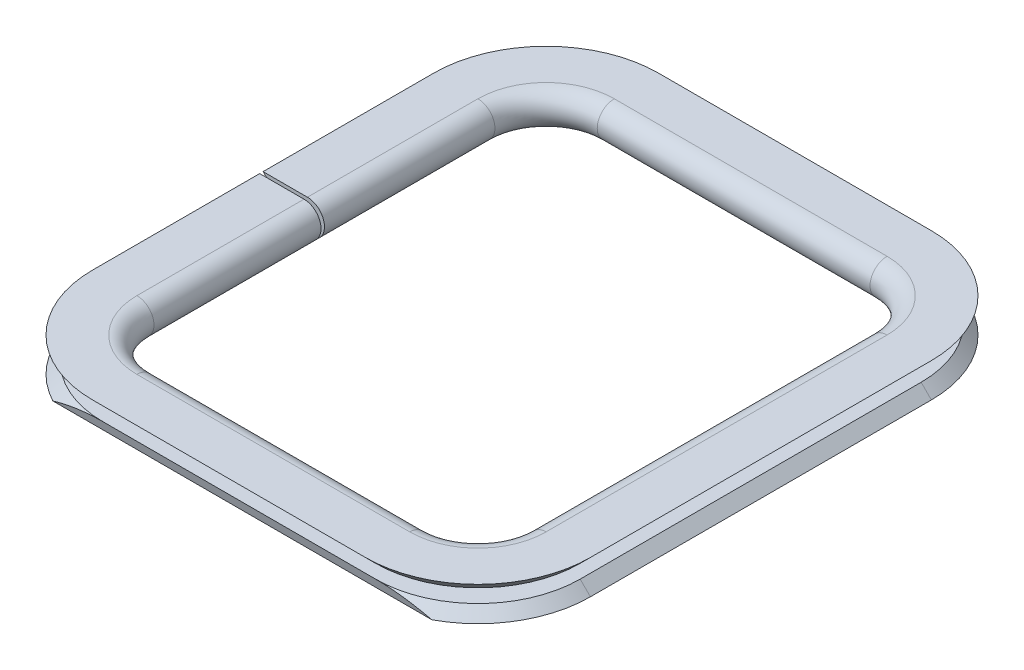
ISO-10303-21;
HEADER;
FILE_DESCRIPTION(('STEP AP214'),'2;1');
FILE_NAME('part.step','',(''),(''),'','','');
FILE_SCHEMA(('AUTOMOTIVE_DESIGN { 1 0 10303 214 1 1 1 1 }'));
ENDSEC;
DATA;
#1=APPLICATION_CONTEXT('core data for automotive mechanical design processes');
#2=APPLICATION_PROTOCOL_DEFINITION('international standard','automotive_design',2000,#1);
#3=PRODUCT_CONTEXT('',#1,'mechanical');
#4=PRODUCT('Part','Part','',(#3));
#5=PRODUCT_RELATED_PRODUCT_CATEGORY('part','',(#4));
#6=PRODUCT_DEFINITION_FORMATION('','',#4);
#7=PRODUCT_DEFINITION_CONTEXT('part definition',#1,'design');
#8=PRODUCT_DEFINITION('design','',#6,#7);
#9=PRODUCT_DEFINITION_SHAPE('','',#8);
#10=(LENGTH_UNIT() NAMED_UNIT(*) SI_UNIT(.MILLI.,.METRE.));
#11=(NAMED_UNIT(*) PLANE_ANGLE_UNIT() SI_UNIT($,.RADIAN.));
#12=(NAMED_UNIT(*) SI_UNIT($,.STERADIAN.) SOLID_ANGLE_UNIT());
#13=UNCERTAINTY_MEASURE_WITH_UNIT(LENGTH_MEASURE(1.E-05),#10,'distance_accuracy_value','');
#14=(GEOMETRIC_REPRESENTATION_CONTEXT(3) GLOBAL_UNCERTAINTY_ASSIGNED_CONTEXT((#13)) GLOBAL_UNIT_ASSIGNED_CONTEXT((#10,
#11,#12)) REPRESENTATION_CONTEXT('',''));
#15=CARTESIAN_POINT('',(0.,0.,0.));
#16=DIRECTION('',(0.,0.,1.));
#17=DIRECTION('',(1.,0.,0.));
#18=AXIS2_PLACEMENT_3D('',#15,#16,#17);
#19=CARTESIAN_POINT('',(-5.00000000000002,-1.,24.9999999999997));
#20=DIRECTION('',(0.707106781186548,-0.707106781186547,0.));
#21=DIRECTION('',(0.707106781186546,0.707106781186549,0.));
#22=AXIS2_PLACEMENT_3D('',#19,#20,#21);
#23=PLANE('',#22);
#24=DIRECTION('',(-0.707106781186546,-0.707106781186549,0.));
#25=VECTOR('',#24,1.);
#26=CARTESIAN_POINT('',(-5.00000000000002,-1.,24.9999999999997));
#27=LINE('',#26,#25);
#28=CARTESIAN_POINT('',(-5.00000000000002,-1.,24.9999999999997));
#29=VERTEX_POINT('',#28);
#30=CARTESIAN_POINT('',(-6.50000000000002,-2.49999999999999,24.9999999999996));
#31=VERTEX_POINT('',#30);
#32=EDGE_CURVE('E360',#29,#31,#27,.T.);
#33=ORIENTED_EDGE('',*,*,#32,.F.);
#34=DIRECTION('',(0.,0.,-1.));
#35=VECTOR('',#34,1.);
#36=CARTESIAN_POINT('',(-5.00000000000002,-1.,24.9999999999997));
#37=LINE('',#36,#35);
#38=CARTESIAN_POINT('',(-5.00000000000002,-1.,0.499999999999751));
#39=VERTEX_POINT('',#38);
#40=EDGE_CURVE('E317',#29,#39,#37,.T.);
#41=ORIENTED_EDGE('',*,*,#40,.T.);
#42=DIRECTION('',(-0.707106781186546,-0.707106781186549,0.));
#43=VECTOR('',#42,1.);
#44=CARTESIAN_POINT('',(-5.00000000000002,-1.,0.499999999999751));
#45=LINE('',#44,#43);
#46=CARTESIAN_POINT('',(-6.50000000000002,-2.5,0.49999999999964));
#47=VERTEX_POINT('',#46);
#48=EDGE_CURVE('E58',#39,#47,#45,.T.);
#49=ORIENTED_EDGE('',*,*,#48,.T.);
#50=DIRECTION('',(0.,0.,-1.));
#51=VECTOR('',#50,1.);
#52=CARTESIAN_POINT('',(-6.50000000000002,-2.49999999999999,24.9999999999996));
#53=LINE('',#52,#51);
#54=EDGE_CURVE('E43',#31,#47,#53,.T.);
#55=ORIENTED_EDGE('',*,*,#54,.F.);
#56=EDGE_LOOP('',(#33,#41,#49,#55));
#57=FACE_BOUND('',#56,.T.);
#58=ADVANCED_FACE('F36',(#57),#23,.F.);
#59=CARTESIAN_POINT('',(0.,-1.,25.));
#60=DIRECTION('',(1.,0.,0.));
#61=DIRECTION('',(0.,0.,-1.));
#62=AXIS2_PLACEMENT_3D('',#59,#60,#61);
#63=PLANE('',#62);
#64=DIRECTION('',(0.,-1.,0.));
#65=VECTOR('',#64,1.);
#66=CARTESIAN_POINT('',(0.,-1.,25.));
#67=LINE('',#66,#65);
#68=CARTESIAN_POINT('',(0.,1.,25.));
#69=VERTEX_POINT('',#68);
#70=CARTESIAN_POINT('',(0.,-1.,25.));
#71=VERTEX_POINT('',#70);
#72=EDGE_CURVE('E362',#69,#71,#67,.T.);
#73=ORIENTED_EDGE('',*,*,#72,.F.);
#74=DIRECTION('',(0.,0.,-1.));
#75=VECTOR('',#74,1.);
#76=CARTESIAN_POINT('',(0.,1.,25.));
#77=LINE('',#76,#75);
#78=CARTESIAN_POINT('',(0.,1.,0.5));
#79=VERTEX_POINT('',#78);
#80=EDGE_CURVE('E353',#69,#79,#77,.T.);
#81=ORIENTED_EDGE('',*,*,#80,.T.);
#82=DIRECTION('',(0.,-1.,0.));
#83=VECTOR('',#82,1.);
#84=CARTESIAN_POINT('',(0.,-1.,0.500000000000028));
#85=LINE('',#84,#83);
#86=CARTESIAN_POINT('',(0.,-1.,0.500000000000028));
#87=VERTEX_POINT('',#86);
#88=EDGE_CURVE('E338',#79,#87,#85,.T.);
#89=ORIENTED_EDGE('',*,*,#88,.T.);
#90=DIRECTION('',(0.,0.,-1.));
#91=VECTOR('',#90,1.);
#92=CARTESIAN_POINT('',(0.,-1.,25.));
#93=LINE('',#92,#91);
#94=EDGE_CURVE('E356',#71,#87,#93,.T.);
#95=ORIENTED_EDGE('',*,*,#94,.F.);
#96=EDGE_LOOP('',(#73,#81,#89,#95));
#97=FACE_BOUND('',#96,.T.);
#98=ADVANCED_FACE('F392',(#97),#63,.F.);
#99=CARTESIAN_POINT('',(-5.00000000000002,1.,24.9999999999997));
#100=DIRECTION('',(0.707106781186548,0.707106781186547,0.));
#101=DIRECTION('',(-0.707106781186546,0.707106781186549,0.));
#102=AXIS2_PLACEMENT_3D('',#99,#100,#101);
#103=PLANE('',#102);
#104=DIRECTION('',(0.707106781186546,-0.707106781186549,0.));
#105=VECTOR('',#104,1.);
#106=CARTESIAN_POINT('',(-5.00000000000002,1.,24.9999999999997));
#107=LINE('',#106,#105);
#108=CARTESIAN_POINT('',(-6.50000000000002,2.5,24.9999999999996));
#109=VERTEX_POINT('',#108);
#110=CARTESIAN_POINT('',(-5.00000000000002,1.,24.9999999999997));
#111=VERTEX_POINT('',#110);
#112=EDGE_CURVE('E368',#109,#111,#107,.T.);
#113=ORIENTED_EDGE('',*,*,#112,.F.);
#114=DIRECTION('',(0.,0.,-1.));
#115=VECTOR('',#114,1.);
#116=CARTESIAN_POINT('',(-6.50000000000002,2.5,24.9999999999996));
#117=LINE('',#116,#115);
#118=CARTESIAN_POINT('',(-6.50000000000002,2.5,0.49999999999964));
#119=VERTEX_POINT('',#118);
#120=EDGE_CURVE('E347',#109,#119,#117,.T.);
#121=ORIENTED_EDGE('',*,*,#120,.T.);
#122=DIRECTION('',(0.707106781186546,-0.707106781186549,0.));
#123=VECTOR('',#122,1.);
#124=CARTESIAN_POINT('',(-5.00000000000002,1.,0.499999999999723));
#125=LINE('',#124,#123);
#126=CARTESIAN_POINT('',(-5.00000000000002,1.,0.499999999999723));
#127=VERTEX_POINT('',#126);
#128=EDGE_CURVE('E334',#119,#127,#125,.T.);
#129=ORIENTED_EDGE('',*,*,#128,.T.);
#130=DIRECTION('',(0.,0.,-1.));
#131=VECTOR('',#130,1.);
#132=CARTESIAN_POINT('',(-5.00000000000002,1.,24.9999999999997));
#133=LINE('',#132,#131);
#134=EDGE_CURVE('E350',#111,#127,#133,.T.);
#135=ORIENTED_EDGE('',*,*,#134,.F.);
#136=EDGE_LOOP('',(#113,#121,#129,#135));
#137=FACE_BOUND('',#136,.T.);
#138=ADVANCED_FACE('F680',(#137),#103,.F.);
#139=CARTESIAN_POINT('',(0.,0.,25.));
#140=DIRECTION('',(0.,0.,-1.));
#141=DIRECTION('',(-1.,0.,0.));
#142=AXIS2_PLACEMENT_3D('',#139,#140,#141);
#143=CYLINDRICAL_SURFACE('',#142,2.5);
#144=CARTESIAN_POINT('',(0.,0.,25.));
#145=DIRECTION('',(0.,0.,1.));
#146=DIRECTION('',(-1.,0.,0.));
#147=AXIS2_PLACEMENT_3D('',#144,#145,#146);
#148=CIRCLE('',#147,2.5);
#149=CARTESIAN_POINT('',(0.,-2.49999999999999,25.));
#150=VERTEX_POINT('',#149);
#151=CARTESIAN_POINT('',(0.,2.5,24.9999999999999));
#152=VERTEX_POINT('',#151);
#153=EDGE_CURVE('E419',#150,#152,#148,.T.);
#154=ORIENTED_EDGE('',*,*,#153,.F.);
#155=DIRECTION('',(0.,0.,-1.));
#156=VECTOR('',#155,1.);
#157=CARTESIAN_POINT('',(0.,-2.49999999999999,25.));
#158=LINE('',#157,#156);
#159=CARTESIAN_POINT('',(0.,-2.5,0.500000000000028));
#160=VERTEX_POINT('',#159);
#161=EDGE_CURVE('E11',#150,#160,#158,.T.);
#162=ORIENTED_EDGE('',*,*,#161,.T.);
#163=CARTESIAN_POINT('',(0.,0.,0.5));
#164=DIRECTION('',(0.,0.,1.));
#165=DIRECTION('',(-1.,0.,0.));
#166=AXIS2_PLACEMENT_3D('',#163,#164,#165);
#167=CIRCLE('',#166,2.5);
#168=CARTESIAN_POINT('',(0.,2.5,0.5));
#169=VERTEX_POINT('',#168);
#170=EDGE_CURVE('E330',#160,#169,#167,.T.);
#171=ORIENTED_EDGE('',*,*,#170,.T.);
#172=DIRECTION('',(0.,0.,-1.));
#173=VECTOR('',#172,1.);
#174=CARTESIAN_POINT('',(0.,2.5,24.9999999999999));
#175=LINE('',#174,#173);
#176=EDGE_CURVE('E344',#152,#169,#175,.T.);
#177=ORIENTED_EDGE('',*,*,#176,.F.);
#178=EDGE_LOOP('',(#154,#162,#171,#177));
#179=FACE_BOUND('',#178,.T.);
#180=ADVANCED_FACE('F684',(#179),#143,.T.);
#181=CARTESIAN_POINT('',(9.99999999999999,-1.,25.));
#182=DIRECTION('',(0.,-1.,0.));
#183=DIRECTION('',(0.,0.,-1.));
#184=AXIS2_PLACEMENT_3D('',#181,#182,#183);
#185=CONICAL_SURFACE('',#184,15.,0.785398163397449);
#186=CARTESIAN_POINT('',(9.99999999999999,-2.5,25.));
#187=DIRECTION('',(0.,-1.,0.));
#188=DIRECTION('',(0.,0.,-1.));
#189=AXIS2_PLACEMENT_3D('',#186,#187,#188);
#190=CIRCLE('',#189,16.5);
#191=CARTESIAN_POINT('',(2.20272032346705,-2.5,39.541403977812));
#192=VERTEX_POINT('',#191);
#193=EDGE_CURVE('E312',#192,#31,#190,.T.);
#194=ORIENTED_EDGE('',*,*,#193,.F.);
#195=CARTESIAN_POINT('',(2.2021830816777,-2.50020000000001,39.5413428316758));
#196=CARTESIAN_POINT('',(2.51389221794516,-2.3841539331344,39.5768216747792));
#197=CARTESIAN_POINT('',(2.82779457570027,-2.27337882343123,39.6106890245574));
#198=CARTESIAN_POINT('',(3.45993302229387,-2.0634490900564,39.6748709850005));
#199=CARTESIAN_POINT('',(3.77817055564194,-1.96429845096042,39.7051843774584));
#200=CARTESIAN_POINT('',(4.41588864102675,-1.77959520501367,39.7616538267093));
#201=CARTESIAN_POINT('',(4.73533347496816,-1.6939303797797,39.7878441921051));
#202=CARTESIAN_POINT('',(5.37787762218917,-1.53624564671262,39.8360532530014));
#203=CARTESIAN_POINT('',(5.70097671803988,-1.46422493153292,39.8580721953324));
#204=CARTESIAN_POINT('',(6.35085099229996,-1.33474981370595,39.8976567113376));
#205=CARTESIAN_POINT('',(6.67763078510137,-1.27731648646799,39.9152158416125));
#206=CARTESIAN_POINT('',(7.33377150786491,-1.1780521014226,39.945564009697));
#207=CARTESIAN_POINT('',(7.66313238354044,-1.13622071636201,39.9583531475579));
#208=CARTESIAN_POINT('',(8.32658992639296,-1.06857265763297,39.9790352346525));
#209=CARTESIAN_POINT('',(8.66070281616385,-1.04289929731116,39.986884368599));
#210=CARTESIAN_POINT('',(9.16259587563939,-1.0171809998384,39.9947472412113));
#211=CARTESIAN_POINT('',(9.33004066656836,-1.01074018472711,39.9967163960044));
#212=CARTESIAN_POINT('',(9.66505419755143,-1.00214766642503,39.9993433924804));
#213=CARTESIAN_POINT('',(9.83262294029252,-0.99999605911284,40.0000012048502));
#214=CARTESIAN_POINT('',(10.0001999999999,-1.00000000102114,39.9999999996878));
#215=B_SPLINE_CURVE_WITH_KNOTS('',3,(#195,#196,#197,#198,#199,#200,#201,#202,#203,#204,#205,
#206,#207,#208,#209,#210,#211,#212,#213,#214),.UNSPECIFIED.,.F.,.F.,(4,2,2,2,2,2,2,2,2,4),(0.,
1.00350352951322,2.00735003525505,3.00234287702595,3.99727682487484,4.99364014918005,
5.98998257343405,6.99504191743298,7.49773028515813,8.00042988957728),.UNSPECIFIED.);
#216=CARTESIAN_POINT('',(9.99999999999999,-1.00000000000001,40.));
#217=VERTEX_POINT('',#216);
#218=EDGE_CURVE('E296',#192,#217,#215,.T.);
#219=ORIENTED_EDGE('',*,*,#218,.T.);
#220=CARTESIAN_POINT('',(9.99999999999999,-1.,25.));
#221=DIRECTION('',(0.,-1.,0.));
#222=DIRECTION('',(0.,0.,-1.));
#223=AXIS2_PLACEMENT_3D('',#220,#221,#222);
#224=CIRCLE('',#223,15.);
#225=EDGE_CURVE('E311',#217,#29,#224,.T.);
#226=ORIENTED_EDGE('',*,*,#225,.T.);
#227=ORIENTED_EDGE('',*,*,#32,.T.);
#228=EDGE_LOOP('',(#194,#219,#226,#227));
#229=FACE_BOUND('',#228,.T.);
#230=ADVANCED_FACE('F309',(#229),#185,.T.);
#231=CARTESIAN_POINT('',(9.99999999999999,0.,25.));
#232=DIRECTION('',(0.,-1.,0.));
#233=DIRECTION('',(0.,0.,-1.));
#234=AXIS2_PLACEMENT_3D('',#231,#232,#233);
#235=CYLINDRICAL_SURFACE('',#234,10.);
#236=DIRECTION('',(0.,-1.,0.));
#237=VECTOR('',#236,1.);
#238=CARTESIAN_POINT('',(10.0000000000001,-1.,35.));
#239=LINE('',#238,#237);
#240=CARTESIAN_POINT('',(10.0000000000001,1.,35.));
#241=VERTEX_POINT('',#240);
#242=CARTESIAN_POINT('',(10.0000000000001,-1.,35.));
#243=VERTEX_POINT('',#242);
#244=EDGE_CURVE('E382',#241,#243,#239,.T.);
#245=ORIENTED_EDGE('',*,*,#244,.F.);
#246=CARTESIAN_POINT('',(9.99999999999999,1.,25.));
#247=DIRECTION('',(0.,-1.,0.));
#248=DIRECTION('',(0.,0.,-1.));
#249=AXIS2_PLACEMENT_3D('',#246,#247,#248);
#250=CIRCLE('',#249,10.);
#251=EDGE_CURVE('E324',#241,#69,#250,.T.);
#252=ORIENTED_EDGE('',*,*,#251,.T.);
#253=ORIENTED_EDGE('',*,*,#72,.T.);
#254=CARTESIAN_POINT('',(9.99999999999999,-1.,25.));
#255=DIRECTION('',(0.,-1.,0.));
#256=DIRECTION('',(0.,0.,-1.));
#257=AXIS2_PLACEMENT_3D('',#254,#255,#256);
#258=CIRCLE('',#257,10.);
#259=EDGE_CURVE('E319',#243,#71,#258,.T.);
#260=ORIENTED_EDGE('',*,*,#259,.F.);
#261=EDGE_LOOP('',(#245,#252,#253,#260));
#262=FACE_BOUND('',#261,.T.);
#263=ADVANCED_FACE('F379',(#262),#235,.T.);
#264=CARTESIAN_POINT('',(9.99999999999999,2.49999999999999,25.));
#265=DIRECTION('',(0.,1.,0.));
#266=DIRECTION('',(0.,0.,1.));
#267=AXIS2_PLACEMENT_3D('',#264,#265,#266);
#268=CONICAL_SURFACE('',#267,16.5,0.785398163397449);
#269=DIRECTION('',(0.,-0.707106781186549,-0.707106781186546));
#270=VECTOR('',#269,1.);
#271=CARTESIAN_POINT('',(9.99999999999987,0.999999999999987,40.));
#272=LINE('',#271,#270);
#273=CARTESIAN_POINT('',(9.9999999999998,2.49999999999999,41.5));
#274=VERTEX_POINT('',#273);
#275=CARTESIAN_POINT('',(9.99999999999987,0.999999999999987,40.));
#276=VERTEX_POINT('',#275);
#277=EDGE_CURVE('E400',#274,#276,#272,.T.);
#278=ORIENTED_EDGE('',*,*,#277,.F.);
#279=CARTESIAN_POINT('',(9.99999999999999,2.49999999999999,25.));
#280=DIRECTION('',(0.,-1.,0.));
#281=DIRECTION('',(0.,0.,-1.));
#282=AXIS2_PLACEMENT_3D('',#279,#280,#281);
#283=CIRCLE('',#282,16.5);
#284=EDGE_CURVE('E365',#274,#109,#283,.T.);
#285=ORIENTED_EDGE('',*,*,#284,.T.);
#286=ORIENTED_EDGE('',*,*,#112,.T.);
#287=CARTESIAN_POINT('',(9.99999999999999,1.,25.));
#288=DIRECTION('',(0.,-1.,0.));
#289=DIRECTION('',(0.,0.,-1.));
#290=AXIS2_PLACEMENT_3D('',#287,#288,#289);
#291=CIRCLE('',#290,15.);
#292=EDGE_CURVE('E374',#276,#111,#291,.T.);
#293=ORIENTED_EDGE('',*,*,#292,.F.);
#294=EDGE_LOOP('',(#278,#285,#286,#293));
#295=FACE_BOUND('',#294,.T.);
#296=ADVANCED_FACE('F425',(#295),#268,.T.);
#297=CARTESIAN_POINT('',(9.99999999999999,0.,25.));
#298=DIRECTION('',(0.,-1.,0.));
#299=DIRECTION('',(0.,0.,-1.));
#300=AXIS2_PLACEMENT_3D('',#297,#298,#299);
#301=TOROIDAL_SURFACE('',#300,10.,2.5);
#302=CARTESIAN_POINT('',(10.0000000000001,0.,35.));
#303=DIRECTION('',(1.,0.,0.));
#304=DIRECTION('',(0.,0.,1.));
#305=AXIS2_PLACEMENT_3D('',#302,#303,#304);
#306=CIRCLE('',#305,2.5);
#307=CARTESIAN_POINT('',(10.0000000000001,-2.5,35.));
#308=VERTEX_POINT('',#307);
#309=CARTESIAN_POINT('',(10.0000000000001,2.49999999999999,35.));
#310=VERTEX_POINT('',#309);
#311=EDGE_CURVE('E406',#308,#310,#306,.T.);
#312=ORIENTED_EDGE('',*,*,#311,.F.);
#313=CARTESIAN_POINT('',(9.99999999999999,-2.5,25.));
#314=DIRECTION('',(0.,-1.,0.));
#315=DIRECTION('',(0.,0.,-1.));
#316=AXIS2_PLACEMENT_3D('',#313,#314,#315);
#317=CIRCLE('',#316,10.);
#318=EDGE_CURVE('E321',#308,#150,#317,.T.);
#319=ORIENTED_EDGE('',*,*,#318,.T.);
#320=ORIENTED_EDGE('',*,*,#153,.T.);
#321=CARTESIAN_POINT('',(9.99999999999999,2.49999999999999,25.));
#322=DIRECTION('',(0.,-1.,0.));
#323=DIRECTION('',(0.,0.,-1.));
#324=AXIS2_PLACEMENT_3D('',#321,#322,#323);
#325=CIRCLE('',#324,10.);
#326=EDGE_CURVE('E361',#310,#152,#325,.T.);
#327=ORIENTED_EDGE('',*,*,#326,.F.);
#328=EDGE_LOOP('',(#312,#319,#320,#327));
#329=FACE_BOUND('',#328,.T.);
#330=ADVANCED_FACE('F1083',(#329),#301,.T.);
#331=CARTESIAN_POINT('',(49.9999999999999,-1.,35.));
#332=DIRECTION('',(0.,0.,-1.));
#333=DIRECTION('',(-1.,0.,0.));
#334=AXIS2_PLACEMENT_3D('',#331,#332,#333);
#335=PLANE('',#334);
#336=DIRECTION('',(0.,-1.,0.));
#337=VECTOR('',#336,1.);
#338=CARTESIAN_POINT('',(49.9999999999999,-1.,35.));
#339=LINE('',#338,#337);
#340=CARTESIAN_POINT('',(49.9999999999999,1.,35.));
#341=VERTEX_POINT('',#340);
#342=CARTESIAN_POINT('',(49.9999999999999,-1.,35.));
#343=VERTEX_POINT('',#342);
#344=EDGE_CURVE('E441',#341,#343,#339,.T.);
#345=ORIENTED_EDGE('',*,*,#344,.F.);
#346=DIRECTION('',(-1.,0.,0.));
#347=VECTOR('',#346,1.);
#348=CARTESIAN_POINT('',(49.9999999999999,1.,35.));
#349=LINE('',#348,#347);
#350=EDGE_CURVE('E387',#341,#241,#349,.T.);
#351=ORIENTED_EDGE('',*,*,#350,.T.);
#352=ORIENTED_EDGE('',*,*,#244,.T.);
#353=DIRECTION('',(-1.,0.,0.));
#354=VECTOR('',#353,1.);
#355=CARTESIAN_POINT('',(49.9999999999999,-1.,35.));
#356=LINE('',#355,#354);
#357=EDGE_CURVE('E304',#343,#243,#356,.T.);
#358=ORIENTED_EDGE('',*,*,#357,.F.);
#359=EDGE_LOOP('',(#345,#351,#352,#358));
#360=FACE_BOUND('',#359,.T.);
#361=ADVANCED_FACE('F397',(#360),#335,.F.);
#362=CARTESIAN_POINT('',(49.9999999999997,1.,40.));
#363=DIRECTION('',(0.,0.707106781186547,-0.707106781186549));
#364=DIRECTION('',(0.,0.707106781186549,0.707106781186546));
#365=AXIS2_PLACEMENT_3D('',#362,#363,#364);
#366=PLANE('',#365);
#367=DIRECTION('',(0.,-0.707106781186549,-0.707106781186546));
#368=VECTOR('',#367,1.);
#369=CARTESIAN_POINT('',(49.9999999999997,1.,40.));
#370=LINE('',#369,#368);
#371=CARTESIAN_POINT('',(49.9999999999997,2.5,41.5));
#372=VERTEX_POINT('',#371);
#373=CARTESIAN_POINT('',(49.9999999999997,1.,40.));
#374=VERTEX_POINT('',#373);
#375=EDGE_CURVE('E434',#372,#374,#370,.T.);
#376=ORIENTED_EDGE('',*,*,#375,.F.);
#377=DIRECTION('',(-1.,0.,0.));
#378=VECTOR('',#377,1.);
#379=CARTESIAN_POINT('',(49.9999999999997,2.5,41.5));
#380=LINE('',#379,#378);
#381=EDGE_CURVE('E403',#372,#274,#380,.T.);
#382=ORIENTED_EDGE('',*,*,#381,.T.);
#383=ORIENTED_EDGE('',*,*,#277,.T.);
#384=DIRECTION('',(-1.,0.,0.));
#385=VECTOR('',#384,1.);
#386=CARTESIAN_POINT('',(49.9999999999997,1.,40.));
#387=LINE('',#386,#385);
#388=EDGE_CURVE('E412',#374,#276,#387,.T.);
#389=ORIENTED_EDGE('',*,*,#388,.F.);
#390=EDGE_LOOP('',(#376,#382,#383,#389));
#391=FACE_BOUND('',#390,.T.);
#392=ADVANCED_FACE('F433',(#391),#366,.F.);
#393=CARTESIAN_POINT('',(49.9999999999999,0.,35.));
#394=DIRECTION('',(-1.,0.,0.));
#395=DIRECTION('',(0.,0.,1.));
#396=AXIS2_PLACEMENT_3D('',#393,#394,#395);
#397=CYLINDRICAL_SURFACE('',#396,2.5);
#398=CARTESIAN_POINT('',(49.9999999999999,0.,35.));
#399=DIRECTION('',(1.,0.,0.));
#400=DIRECTION('',(0.,0.,1.));
#401=AXIS2_PLACEMENT_3D('',#398,#399,#400);
#402=CIRCLE('',#401,2.5);
#403=CARTESIAN_POINT('',(49.9999999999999,-2.49999999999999,35.));
#404=VERTEX_POINT('',#403);
#405=CARTESIAN_POINT('',(49.9999999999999,2.5,35.));
#406=VERTEX_POINT('',#405);
#407=EDGE_CURVE('E442',#404,#406,#402,.T.);
#408=ORIENTED_EDGE('',*,*,#407,.F.);
#409=DIRECTION('',(-1.,0.,0.));
#410=VECTOR('',#409,1.);
#411=CARTESIAN_POINT('',(49.9999999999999,-2.49999999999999,35.));
#412=LINE('',#411,#410);
#413=EDGE_CURVE('E303',#404,#308,#412,.T.);
#414=ORIENTED_EDGE('',*,*,#413,.T.);
#415=ORIENTED_EDGE('',*,*,#311,.T.);
#416=DIRECTION('',(-1.,0.,0.));
#417=VECTOR('',#416,1.);
#418=CARTESIAN_POINT('',(49.9999999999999,2.5,35.));
#419=LINE('',#418,#417);
#420=EDGE_CURVE('E399',#406,#310,#419,.T.);
#421=ORIENTED_EDGE('',*,*,#420,.F.);
#422=EDGE_LOOP('',(#408,#414,#415,#421));
#423=FACE_BOUND('',#422,.T.);
#424=ADVANCED_FACE('F471',(#423),#397,.T.);
#425=CARTESIAN_POINT('',(50.,-0.999999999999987,25.));
#426=DIRECTION('',(0.,-1.,0.));
#427=DIRECTION('',(0.,0.,-1.));
#428=AXIS2_PLACEMENT_3D('',#425,#426,#427);
#429=CONICAL_SURFACE('',#428,15.,0.785398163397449);
#430=CARTESIAN_POINT('',(50.,-0.999999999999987,25.));
#431=DIRECTION('',(0.,-1.,0.));
#432=DIRECTION('',(0.,0.,-1.));
#433=AXIS2_PLACEMENT_3D('',#430,#431,#432);
#434=CIRCLE('',#433,15.);
#435=CARTESIAN_POINT('',(65.,-1.,25.));
#436=VERTEX_POINT('',#435);
#437=CARTESIAN_POINT('',(49.9999999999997,-1.,40.));
#438=VERTEX_POINT('',#437);
#439=EDGE_CURVE('E460',#436,#438,#434,.T.);
#440=ORIENTED_EDGE('',*,*,#439,.T.);
#441=CARTESIAN_POINT('',(49.9997999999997,-1.00000000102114,39.9999999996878));
#442=CARTESIAN_POINT('',(50.2779141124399,-0.999971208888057,40.0000088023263));
#443=CARTESIAN_POINT('',(50.556019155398,-1.00591732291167,39.9981908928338));
#444=CARTESIAN_POINT('',(51.1116486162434,-1.02956695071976,39.9909604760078));
#445=CARTESIAN_POINT('',(51.3891731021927,-1.04726899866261,39.9855484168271));
#446=CARTESIAN_POINT('',(51.9428298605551,-1.09421114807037,39.9711967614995));
#447=CARTESIAN_POINT('',(52.218963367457,-1.1234379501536,39.9622612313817));
#448=CARTESIAN_POINT('',(52.7696737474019,-1.19306034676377,39.9409755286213));
#449=CARTESIAN_POINT('',(53.0442505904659,-1.23345615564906,39.9286252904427));
#450=CARTESIAN_POINT('',(53.8580528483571,-1.36956764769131,39.8870118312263));
#451=CARTESIAN_POINT('',(54.394495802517,-1.48083667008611,39.8529934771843));
#452=CARTESIAN_POINT('',(55.4572116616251,-1.74074452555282,39.773531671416));
#453=CARTESIAN_POINT('',(55.9834851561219,-1.88938118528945,39.7280888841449));
#454=CARTESIAN_POINT('',(56.7213660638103,-2.12301140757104,39.6566609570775));
#455=CARTESIAN_POINT('',(56.9377037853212,-2.19464563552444,39.6347601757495));
#456=CARTESIAN_POINT('',(57.3689713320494,-2.3434138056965,39.5892771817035));
#457=CARTESIAN_POINT('',(57.5838956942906,-2.4205622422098,39.5656905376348));
#458=CARTESIAN_POINT('',(57.7978169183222,-2.50020000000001,39.5413428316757));
#459=B_SPLINE_CURVE_WITH_KNOTS('',3,(#441,#442,#443,#444,#445,#446,#447,#448,#449,#450,#451,
#452,#453,#454,#455,#456,#457,#458),.UNSPECIFIED.,.F.,.F.,(4,2,2,2,2,2,2,2,4),(0.,
0.834257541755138,1.66841107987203,2.50160482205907,3.33481455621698,4.97977312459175,
6.62463604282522,7.31139498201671,8.00003064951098),.UNSPECIFIED.);
#460=CARTESIAN_POINT('',(57.7972796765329,-2.50000000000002,39.541403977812));
#461=VERTEX_POINT('',#460);
#462=EDGE_CURVE('E299',#438,#461,#459,.T.);
#463=ORIENTED_EDGE('',*,*,#462,.T.);
#464=CARTESIAN_POINT('',(50.,-2.49999999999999,25.));
#465=DIRECTION('',(0.,-1.,0.));
#466=DIRECTION('',(0.,0.,-1.));
#467=AXIS2_PLACEMENT_3D('',#464,#465,#466);
#468=CIRCLE('',#467,16.5);
#469=CARTESIAN_POINT('',(66.5,-2.5,25.0000000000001));
#470=VERTEX_POINT('',#469);
#471=EDGE_CURVE('E462',#470,#461,#468,.T.);
#472=ORIENTED_EDGE('',*,*,#471,.F.);
#473=DIRECTION('',(0.707106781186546,-0.707106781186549,0.));
#474=VECTOR('',#473,1.);
#475=CARTESIAN_POINT('',(65.,-1.,25.));
#476=LINE('',#475,#474);
#477=EDGE_CURVE('E501',#436,#470,#476,.T.);
#478=ORIENTED_EDGE('',*,*,#477,.F.);
#479=EDGE_LOOP('',(#440,#463,#472,#478));
#480=FACE_BOUND('',#479,.T.);
#481=ADVANCED_FACE('F1053',(#480),#429,.T.);
#482=CARTESIAN_POINT('',(50.,0.,25.));
#483=DIRECTION('',(0.,-1.,0.));
#484=DIRECTION('',(0.,0.,-1.));
#485=AXIS2_PLACEMENT_3D('',#482,#483,#484);
#486=CYLINDRICAL_SURFACE('',#485,10.);
#487=DIRECTION('',(0.,-1.,0.));
#488=VECTOR('',#487,1.);
#489=CARTESIAN_POINT('',(60.,-1.,24.9999999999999));
#490=LINE('',#489,#488);
#491=CARTESIAN_POINT('',(60.,1.,24.9999999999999));
#492=VERTEX_POINT('',#491);
#493=CARTESIAN_POINT('',(60.,-1.,24.9999999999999));
#494=VERTEX_POINT('',#493);
#495=EDGE_CURVE('E492',#492,#494,#490,.T.);
#496=ORIENTED_EDGE('',*,*,#495,.F.);
#497=CARTESIAN_POINT('',(50.,1.,25.));
#498=DIRECTION('',(0.,-1.,0.));
#499=DIRECTION('',(0.,0.,-1.));
#500=AXIS2_PLACEMENT_3D('',#497,#498,#499);
#501=CIRCLE('',#500,10.);
#502=EDGE_CURVE('E455',#492,#341,#501,.T.);
#503=ORIENTED_EDGE('',*,*,#502,.T.);
#504=ORIENTED_EDGE('',*,*,#344,.T.);
#505=CARTESIAN_POINT('',(50.,-0.999999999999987,25.));
#506=DIRECTION('',(0.,-1.,0.));
#507=DIRECTION('',(0.,0.,-1.));
#508=AXIS2_PLACEMENT_3D('',#505,#506,#507);
#509=CIRCLE('',#508,10.);
#510=EDGE_CURVE('E458',#494,#343,#509,.T.);
#511=ORIENTED_EDGE('',*,*,#510,.F.);
#512=EDGE_LOOP('',(#496,#503,#504,#511));
#513=FACE_BOUND('',#512,.T.);
#514=ADVANCED_FACE('F1045',(#513),#486,.T.);
#515=CARTESIAN_POINT('',(50.,2.5,25.));
#516=DIRECTION('',(0.,1.,0.));
#517=DIRECTION('',(0.,0.,1.));
#518=AXIS2_PLACEMENT_3D('',#515,#516,#517);
#519=CONICAL_SURFACE('',#518,16.5,0.785398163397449);
#520=DIRECTION('',(-0.707106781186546,-0.707106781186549,0.));
#521=VECTOR('',#520,1.);
#522=CARTESIAN_POINT('',(65.,1.,25.));
#523=LINE('',#522,#521);
#524=CARTESIAN_POINT('',(66.5,2.5,25.0000000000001));
#525=VERTEX_POINT('',#524);
#526=CARTESIAN_POINT('',(65.,1.,25.));
#527=VERTEX_POINT('',#526);
#528=EDGE_CURVE('E489',#525,#527,#523,.T.);
#529=ORIENTED_EDGE('',*,*,#528,.F.);
#530=CARTESIAN_POINT('',(50.,2.5,25.));
#531=DIRECTION('',(0.,-1.,0.));
#532=DIRECTION('',(0.,0.,-1.));
#533=AXIS2_PLACEMENT_3D('',#530,#531,#532);
#534=CIRCLE('',#533,16.5);
#535=EDGE_CURVE('E440',#525,#372,#534,.T.);
#536=ORIENTED_EDGE('',*,*,#535,.T.);
#537=ORIENTED_EDGE('',*,*,#375,.T.);
#538=CARTESIAN_POINT('',(50.,1.,25.));
#539=DIRECTION('',(0.,-1.,0.));
#540=DIRECTION('',(0.,0.,-1.));
#541=AXIS2_PLACEMENT_3D('',#538,#539,#540);
#542=CIRCLE('',#541,15.);
#543=EDGE_CURVE('E429',#527,#374,#542,.T.);
#544=ORIENTED_EDGE('',*,*,#543,.F.);
#545=EDGE_LOOP('',(#529,#536,#537,#544));
#546=FACE_BOUND('',#545,.T.);
#547=ADVANCED_FACE('F438',(#546),#519,.T.);
#548=CARTESIAN_POINT('',(50.,0.,25.));
#549=DIRECTION('',(0.,-1.,0.));
#550=DIRECTION('',(0.,0.,-1.));
#551=AXIS2_PLACEMENT_3D('',#548,#549,#550);
#552=TOROIDAL_SURFACE('',#551,10.,2.5);
#553=CARTESIAN_POINT('',(60.,0.,24.9999999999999));
#554=DIRECTION('',(0.,0.,-1.));
#555=DIRECTION('',(1.,0.,0.));
#556=AXIS2_PLACEMENT_3D('',#553,#554,#555);
#557=CIRCLE('',#556,2.5);
#558=CARTESIAN_POINT('',(60.,-2.5,24.9999999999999));
#559=VERTEX_POINT('',#558);
#560=CARTESIAN_POINT('',(60.,2.49999999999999,24.9999999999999));
#561=VERTEX_POINT('',#560);
#562=EDGE_CURVE('E483',#559,#561,#557,.T.);
#563=ORIENTED_EDGE('',*,*,#562,.F.);
#564=CARTESIAN_POINT('',(50.,-2.49999999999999,25.));
#565=DIRECTION('',(0.,-1.,0.));
#566=DIRECTION('',(0.,0.,-1.));
#567=AXIS2_PLACEMENT_3D('',#564,#565,#566);
#568=CIRCLE('',#567,10.);
#569=EDGE_CURVE('E465',#559,#404,#568,.T.);
#570=ORIENTED_EDGE('',*,*,#569,.T.);
#571=ORIENTED_EDGE('',*,*,#407,.T.);
#572=CARTESIAN_POINT('',(50.,2.5,25.));
#573=DIRECTION('',(0.,-1.,0.));
#574=DIRECTION('',(0.,0.,-1.));
#575=AXIS2_PLACEMENT_3D('',#572,#573,#574);
#576=CIRCLE('',#575,10.);
#577=EDGE_CURVE('E444',#561,#406,#576,.T.);
#578=ORIENTED_EDGE('',*,*,#577,.F.);
#579=EDGE_LOOP('',(#563,#570,#571,#578));
#580=FACE_BOUND('',#579,.T.);
#581=ADVANCED_FACE('F482',(#580),#552,.T.);
#582=CARTESIAN_POINT('',(65.,-1.,-24.9999999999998));
#583=DIRECTION('',(-0.707106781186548,-0.707106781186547,0.));
#584=DIRECTION('',(0.707106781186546,-0.707106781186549,0.));
#585=AXIS2_PLACEMENT_3D('',#582,#583,#584);
#586=PLANE('',#585);
#587=DIRECTION('',(0.707106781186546,-0.707106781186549,0.));
#588=VECTOR('',#587,1.);
#589=CARTESIAN_POINT('',(65.,-1.,-24.9999999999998));
#590=LINE('',#589,#588);
#591=CARTESIAN_POINT('',(65.,-1.,-24.9999999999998));
#592=VERTEX_POINT('',#591);
#593=CARTESIAN_POINT('',(66.5,-2.5,-24.9999999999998));
#594=VERTEX_POINT('',#593);
#595=EDGE_CURVE('E527',#592,#594,#590,.T.);
#596=ORIENTED_EDGE('',*,*,#595,.F.);
#597=DIRECTION('',(0.,0.,1.));
#598=VECTOR('',#597,1.);
#599=CARTESIAN_POINT('',(65.,-1.,-24.9999999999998));
#600=LINE('',#599,#598);
#601=EDGE_CURVE('E516',#592,#436,#600,.T.);
#602=ORIENTED_EDGE('',*,*,#601,.T.);
#603=ORIENTED_EDGE('',*,*,#477,.T.);
#604=DIRECTION('',(0.,0.,1.));
#605=VECTOR('',#604,1.);
#606=CARTESIAN_POINT('',(66.5,-2.5,-24.9999999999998));
#607=LINE('',#606,#605);
#608=EDGE_CURVE('E519',#594,#470,#607,.T.);
#609=ORIENTED_EDGE('',*,*,#608,.F.);
#610=EDGE_LOOP('',(#596,#602,#603,#609));
#611=FACE_BOUND('',#610,.T.);
#612=ADVANCED_FACE('F526',(#611),#586,.F.);
#613=CARTESIAN_POINT('',(60.,-1.,-25.));
#614=DIRECTION('',(-1.,0.,0.));
#615=DIRECTION('',(0.,0.,1.));
#616=AXIS2_PLACEMENT_3D('',#613,#614,#615);
#617=PLANE('',#616);
#618=DIRECTION('',(0.,-1.,0.));
#619=VECTOR('',#618,1.);
#620=CARTESIAN_POINT('',(60.,-1.,-25.));
#621=LINE('',#620,#619);
#622=CARTESIAN_POINT('',(60.,1.,-25.));
#623=VERTEX_POINT('',#622);
#624=CARTESIAN_POINT('',(60.,-1.,-25.));
#625=VERTEX_POINT('',#624);
#626=EDGE_CURVE('E536',#623,#625,#621,.T.);
#627=ORIENTED_EDGE('',*,*,#626,.F.);
#628=DIRECTION('',(0.,0.,1.));
#629=VECTOR('',#628,1.);
#630=CARTESIAN_POINT('',(60.,1.,-25.));
#631=LINE('',#630,#629);
#632=EDGE_CURVE('E510',#623,#492,#631,.T.);
#633=ORIENTED_EDGE('',*,*,#632,.T.);
#634=ORIENTED_EDGE('',*,*,#495,.T.);
#635=DIRECTION('',(0.,0.,1.));
#636=VECTOR('',#635,1.);
#637=CARTESIAN_POINT('',(60.,-1.,-25.));
#638=LINE('',#637,#636);
#639=EDGE_CURVE('E513',#625,#494,#638,.T.);
#640=ORIENTED_EDGE('',*,*,#639,.F.);
#641=EDGE_LOOP('',(#627,#633,#634,#640));
#642=FACE_BOUND('',#641,.T.);
#643=ADVANCED_FACE('F1015',(#642),#617,.F.);
#644=CARTESIAN_POINT('',(65.,1.,-24.9999999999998));
#645=DIRECTION('',(-0.707106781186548,0.707106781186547,0.));
#646=DIRECTION('',(-0.707106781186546,-0.707106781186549,0.));
#647=AXIS2_PLACEMENT_3D('',#644,#645,#646);
#648=PLANE('',#647);
#649=DIRECTION('',(-0.707106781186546,-0.707106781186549,0.));
#650=VECTOR('',#649,1.);
#651=CARTESIAN_POINT('',(65.,1.,-24.9999999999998));
#652=LINE('',#651,#650);
#653=CARTESIAN_POINT('',(66.5,2.5,-24.9999999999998));
#654=VERTEX_POINT('',#653);
#655=CARTESIAN_POINT('',(65.,1.,-24.9999999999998));
#656=VERTEX_POINT('',#655);
#657=EDGE_CURVE('E541',#654,#656,#652,.T.);
#658=ORIENTED_EDGE('',*,*,#657,.F.);
#659=DIRECTION('',(0.,0.,1.));
#660=VECTOR('',#659,1.);
#661=CARTESIAN_POINT('',(66.5,2.5,-24.9999999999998));
#662=LINE('',#661,#660);
#663=EDGE_CURVE('E505',#654,#525,#662,.T.);
#664=ORIENTED_EDGE('',*,*,#663,.T.);
#665=ORIENTED_EDGE('',*,*,#528,.T.);
#666=DIRECTION('',(0.,0.,1.));
#667=VECTOR('',#666,1.);
#668=CARTESIAN_POINT('',(65.,1.,-24.9999999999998));
#669=LINE('',#668,#667);
#670=EDGE_CURVE('E508',#656,#527,#669,.T.);
#671=ORIENTED_EDGE('',*,*,#670,.F.);
#672=EDGE_LOOP('',(#658,#664,#665,#671));
#673=FACE_BOUND('',#672,.T.);
#674=ADVANCED_FACE('F1007',(#673),#648,.F.);
#675=CARTESIAN_POINT('',(60.,0.,-25.));
#676=DIRECTION('',(0.,0.,1.));
#677=DIRECTION('',(1.,0.,0.));
#678=AXIS2_PLACEMENT_3D('',#675,#676,#677);
#679=CYLINDRICAL_SURFACE('',#678,2.5);
#680=CARTESIAN_POINT('',(60.,0.,-25.));
#681=DIRECTION('',(0.,0.,-1.));
#682=DIRECTION('',(1.,0.,0.));
#683=AXIS2_PLACEMENT_3D('',#680,#681,#682);
#684=CIRCLE('',#683,2.5);
#685=CARTESIAN_POINT('',(60.,-2.5,-25.));
#686=VERTEX_POINT('',#685);
#687=CARTESIAN_POINT('',(60.,2.5,-25.));
#688=VERTEX_POINT('',#687);
#689=EDGE_CURVE('E599',#686,#688,#684,.T.);
#690=ORIENTED_EDGE('',*,*,#689,.F.);
#691=DIRECTION('',(0.,0.,1.));
#692=VECTOR('',#691,1.);
#693=CARTESIAN_POINT('',(60.,-2.5,-25.));
#694=LINE('',#693,#692);
#695=EDGE_CURVE('E447',#686,#559,#694,.T.);
#696=ORIENTED_EDGE('',*,*,#695,.T.);
#697=ORIENTED_EDGE('',*,*,#562,.T.);
#698=DIRECTION('',(0.,0.,1.));
#699=VECTOR('',#698,1.);
#700=CARTESIAN_POINT('',(60.,2.5,-25.));
#701=LINE('',#700,#699);
#702=EDGE_CURVE('E478',#688,#561,#701,.T.);
#703=ORIENTED_EDGE('',*,*,#702,.F.);
#704=EDGE_LOOP('',(#690,#696,#697,#703));
#705=FACE_BOUND('',#704,.T.);
#706=ADVANCED_FACE('F487',(#705),#679,.T.);
#707=CARTESIAN_POINT('',(50.,-0.999999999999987,-25.));
#708=DIRECTION('',(0.,-1.,0.));
#709=DIRECTION('',(0.,0.,-1.));
#710=AXIS2_PLACEMENT_3D('',#707,#708,#709);
#711=CONICAL_SURFACE('',#710,15.,0.785398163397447);
#712=DIRECTION('',(0.,-0.707106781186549,-0.707106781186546));
#713=VECTOR('',#712,1.);
#714=CARTESIAN_POINT('',(50.,-1.,-40.));
#715=LINE('',#714,#713);
#716=CARTESIAN_POINT('',(50.,-1.,-40.));
#717=VERTEX_POINT('',#716);
#718=CARTESIAN_POINT('',(50.,-2.5,-41.5));
#719=VERTEX_POINT('',#718);
#720=EDGE_CURVE('E571',#717,#719,#715,.T.);
#721=ORIENTED_EDGE('',*,*,#720,.F.);
#722=CARTESIAN_POINT('',(50.,-0.999999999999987,-25.));
#723=DIRECTION('',(0.,-1.,0.));
#724=DIRECTION('',(0.,0.,-1.));
#725=AXIS2_PLACEMENT_3D('',#722,#723,#724);
#726=CIRCLE('',#725,15.);
#727=EDGE_CURVE('E534',#717,#592,#726,.T.);
#728=ORIENTED_EDGE('',*,*,#727,.T.);
#729=ORIENTED_EDGE('',*,*,#595,.T.);
#730=CARTESIAN_POINT('',(50.,-2.49999999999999,-25.));
#731=DIRECTION('',(0.,-1.,0.));
#732=DIRECTION('',(0.,0.,-1.));
#733=AXIS2_PLACEMENT_3D('',#730,#731,#732);
#734=CIRCLE('',#733,16.5);
#735=EDGE_CURVE('E495',#719,#594,#734,.T.);
#736=ORIENTED_EDGE('',*,*,#735,.F.);
#737=EDGE_LOOP('',(#721,#728,#729,#736));
#738=FACE_BOUND('',#737,.T.);
#739=ADVANCED_FACE('F532',(#738),#711,.T.);
#740=CARTESIAN_POINT('',(50.,0.,-25.));
#741=DIRECTION('',(0.,-1.,0.));
#742=DIRECTION('',(0.,0.,-1.));
#743=AXIS2_PLACEMENT_3D('',#740,#741,#742);
#744=CYLINDRICAL_SURFACE('',#743,9.99999999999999);
#745=DIRECTION('',(0.,-1.,0.));
#746=VECTOR('',#745,1.);
#747=CARTESIAN_POINT('',(49.9999999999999,-0.999999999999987,-35.));
#748=LINE('',#747,#746);
#749=CARTESIAN_POINT('',(49.9999999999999,1.00000000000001,-35.));
#750=VERTEX_POINT('',#749);
#751=CARTESIAN_POINT('',(49.9999999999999,-0.999999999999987,-35.));
#752=VERTEX_POINT('',#751);
#753=EDGE_CURVE('E563',#750,#752,#748,.T.);
#754=ORIENTED_EDGE('',*,*,#753,.F.);
#755=CARTESIAN_POINT('',(50.,1.,-25.));
#756=DIRECTION('',(0.,-1.,0.));
#757=DIRECTION('',(0.,0.,-1.));
#758=AXIS2_PLACEMENT_3D('',#755,#756,#757);
#759=CIRCLE('',#758,9.99999999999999);
#760=EDGE_CURVE('E550',#750,#623,#759,.T.);
#761=ORIENTED_EDGE('',*,*,#760,.T.);
#762=ORIENTED_EDGE('',*,*,#626,.T.);
#763=CARTESIAN_POINT('',(50.,-0.999999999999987,-25.));
#764=DIRECTION('',(0.,-1.,0.));
#765=DIRECTION('',(0.,0.,-1.));
#766=AXIS2_PLACEMENT_3D('',#763,#764,#765);
#767=CIRCLE('',#766,9.99999999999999);
#768=EDGE_CURVE('E553',#752,#625,#767,.T.);
#769=ORIENTED_EDGE('',*,*,#768,.F.);
#770=EDGE_LOOP('',(#754,#761,#762,#769));
#771=FACE_BOUND('',#770,.T.);
#772=ADVANCED_FACE('F562',(#771),#744,.T.);
#773=CARTESIAN_POINT('',(50.,2.5,-25.));
#774=DIRECTION('',(0.,1.,0.));
#775=DIRECTION('',(0.,0.,1.));
#776=AXIS2_PLACEMENT_3D('',#773,#774,#775);
#777=CONICAL_SURFACE('',#776,16.5,0.785398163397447);
#778=DIRECTION('',(0.,-0.707106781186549,0.707106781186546));
#779=VECTOR('',#778,1.);
#780=CARTESIAN_POINT('',(50.,1.,-40.));
#781=LINE('',#780,#779);
#782=CARTESIAN_POINT('',(50.,2.5,-41.5));
#783=VERTEX_POINT('',#782);
#784=CARTESIAN_POINT('',(50.,1.,-40.));
#785=VERTEX_POINT('',#784);
#786=EDGE_CURVE('E572',#783,#785,#781,.T.);
#787=ORIENTED_EDGE('',*,*,#786,.F.);
#788=CARTESIAN_POINT('',(50.,2.5,-25.));
#789=DIRECTION('',(0.,-1.,0.));
#790=DIRECTION('',(0.,0.,-1.));
#791=AXIS2_PLACEMENT_3D('',#788,#789,#790);
#792=CIRCLE('',#791,16.5);
#793=EDGE_CURVE('E538',#783,#654,#792,.T.);
#794=ORIENTED_EDGE('',*,*,#793,.T.);
#795=ORIENTED_EDGE('',*,*,#657,.T.);
#796=CARTESIAN_POINT('',(50.,1.,-25.));
#797=DIRECTION('',(0.,-1.,0.));
#798=DIRECTION('',(0.,0.,-1.));
#799=AXIS2_PLACEMENT_3D('',#796,#797,#798);
#800=CIRCLE('',#799,15.);
#801=EDGE_CURVE('E547',#785,#656,#800,.T.);
#802=ORIENTED_EDGE('',*,*,#801,.F.);
#803=EDGE_LOOP('',(#787,#794,#795,#802));
#804=FACE_BOUND('',#803,.T.);
#805=ADVANCED_FACE('F604',(#804),#777,.T.);
#806=CARTESIAN_POINT('',(50.,0.,-25.));
#807=DIRECTION('',(0.,-1.,0.));
#808=DIRECTION('',(0.,0.,-1.));
#809=AXIS2_PLACEMENT_3D('',#806,#807,#808);
#810=TOROIDAL_SURFACE('',#809,9.99999999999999,2.5);
#811=CARTESIAN_POINT('',(49.9999999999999,0.,-35.));
#812=DIRECTION('',(-1.,0.,0.));
#813=DIRECTION('',(0.,0.,-1.));
#814=AXIS2_PLACEMENT_3D('',#811,#812,#813);
#815=CIRCLE('',#814,2.5);
#816=CARTESIAN_POINT('',(49.9999999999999,-2.49999999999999,-35.));
#817=VERTEX_POINT('',#816);
#818=CARTESIAN_POINT('',(49.9999999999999,2.5,-35.));
#819=VERTEX_POINT('',#818);
#820=EDGE_CURVE('E577',#817,#819,#815,.T.);
#821=ORIENTED_EDGE('',*,*,#820,.F.);
#822=CARTESIAN_POINT('',(50.,-2.49999999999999,-25.));
#823=DIRECTION('',(0.,-1.,0.));
#824=DIRECTION('',(0.,0.,-1.));
#825=AXIS2_PLACEMENT_3D('',#822,#823,#824);
#826=CIRCLE('',#825,9.99999999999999);
#827=EDGE_CURVE('E490',#817,#686,#826,.T.);
#828=ORIENTED_EDGE('',*,*,#827,.T.);
#829=ORIENTED_EDGE('',*,*,#689,.T.);
#830=CARTESIAN_POINT('',(50.,2.5,-25.));
#831=DIRECTION('',(0.,-1.,0.));
#832=DIRECTION('',(0.,0.,-1.));
#833=AXIS2_PLACEMENT_3D('',#830,#831,#832);
#834=CIRCLE('',#833,9.99999999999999);
#835=EDGE_CURVE('E535',#819,#688,#834,.T.);
#836=ORIENTED_EDGE('',*,*,#835,.F.);
#837=EDGE_LOOP('',(#821,#828,#829,#836));
#838=FACE_BOUND('',#837,.T.);
#839=ADVANCED_FACE('F665',(#838),#810,.T.);
#840=CARTESIAN_POINT('',(10.0000000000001,-1.00000000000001,-40.));
#841=DIRECTION('',(0.,-0.707106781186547,0.707106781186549));
#842=DIRECTION('',(0.,-0.707106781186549,-0.707106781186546));
#843=AXIS2_PLACEMENT_3D('',#840,#841,#842);
#844=PLANE('',#843);
#845=DIRECTION('',(0.,-0.707106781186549,-0.707106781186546));
#846=VECTOR('',#845,1.);
#847=CARTESIAN_POINT('',(10.0000000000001,-1.00000000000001,-40.));
#848=LINE('',#847,#846);
#849=CARTESIAN_POINT('',(10.0000000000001,-1.00000000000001,-40.));
#850=VERTEX_POINT('',#849);
#851=CARTESIAN_POINT('',(10.0000000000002,-2.50000000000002,-41.5));
#852=VERTEX_POINT('',#851);
#853=EDGE_CURVE('E622',#850,#852,#848,.T.);
#854=ORIENTED_EDGE('',*,*,#853,.F.);
#855=DIRECTION('',(1.,0.,0.));
#856=VECTOR('',#855,1.);
#857=CARTESIAN_POINT('',(10.0000000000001,-1.00000000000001,-40.));
#858=LINE('',#857,#856);
#859=EDGE_CURVE('E591',#850,#717,#858,.T.);
#860=ORIENTED_EDGE('',*,*,#859,.T.);
#861=ORIENTED_EDGE('',*,*,#720,.T.);
#862=DIRECTION('',(1.,0.,0.));
#863=VECTOR('',#862,1.);
#864=CARTESIAN_POINT('',(10.0000000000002,-2.50000000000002,-41.5));
#865=LINE('',#864,#863);
#866=EDGE_CURVE('E594',#852,#719,#865,.T.);
#867=ORIENTED_EDGE('',*,*,#866,.F.);
#868=EDGE_LOOP('',(#854,#860,#861,#867));
#869=FACE_BOUND('',#868,.T.);
#870=ADVANCED_FACE('F667',(#869),#844,.F.);
#871=CARTESIAN_POINT('',(10.0000000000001,-1.,-35.));
#872=DIRECTION('',(0.,0.,1.));
#873=DIRECTION('',(1.,0.,0.));
#874=AXIS2_PLACEMENT_3D('',#871,#872,#873);
#875=PLANE('',#874);
#876=DIRECTION('',(0.,-1.,0.));
#877=VECTOR('',#876,1.);
#878=CARTESIAN_POINT('',(10.0000000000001,-1.,-35.));
#879=LINE('',#878,#877);
#880=CARTESIAN_POINT('',(10.0000000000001,1.,-35.));
#881=VERTEX_POINT('',#880);
#882=CARTESIAN_POINT('',(10.0000000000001,-1.,-35.));
#883=VERTEX_POINT('',#882);
#884=EDGE_CURVE('E619',#881,#883,#879,.T.);
#885=ORIENTED_EDGE('',*,*,#884,.F.);
#886=DIRECTION('',(1.,0.,0.));
#887=VECTOR('',#886,1.);
#888=CARTESIAN_POINT('',(10.0000000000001,1.,-35.));
#889=LINE('',#888,#887);
#890=EDGE_CURVE('E570',#881,#750,#889,.T.);
#891=ORIENTED_EDGE('',*,*,#890,.T.);
#892=ORIENTED_EDGE('',*,*,#753,.T.);
#893=DIRECTION('',(1.,0.,0.));
#894=VECTOR('',#893,1.);
#895=CARTESIAN_POINT('',(10.0000000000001,-1.,-35.));
#896=LINE('',#895,#894);
#897=EDGE_CURVE('E558',#883,#752,#896,.T.);
#898=ORIENTED_EDGE('',*,*,#897,.F.);
#899=EDGE_LOOP('',(#885,#891,#892,#898));
#900=FACE_BOUND('',#899,.T.);
#901=ADVANCED_FACE('F568',(#900),#875,.F.);
#902=CARTESIAN_POINT('',(10.0000000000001,0.999999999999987,-40.));
#903=DIRECTION('',(0.,0.707106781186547,0.707106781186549));
#904=DIRECTION('',(0.,-0.707106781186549,0.707106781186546));
#905=AXIS2_PLACEMENT_3D('',#902,#903,#904);
#906=PLANE('',#905);
#907=DIRECTION('',(0.,-0.707106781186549,0.707106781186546));
#908=VECTOR('',#907,1.);
#909=CARTESIAN_POINT('',(10.0000000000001,0.999999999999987,-40.));
#910=LINE('',#909,#908);
#911=CARTESIAN_POINT('',(10.0000000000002,2.49999999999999,-41.5));
#912=VERTEX_POINT('',#911);
#913=CARTESIAN_POINT('',(10.0000000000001,0.999999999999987,-40.));
#914=VERTEX_POINT('',#913);
#915=EDGE_CURVE('E613',#912,#914,#910,.T.);
#916=ORIENTED_EDGE('',*,*,#915,.F.);
#917=DIRECTION('',(1.,0.,0.));
#918=VECTOR('',#917,1.);
#919=CARTESIAN_POINT('',(10.0000000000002,2.49999999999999,-41.5));
#920=LINE('',#919,#918);
#921=EDGE_CURVE('E583',#912,#783,#920,.T.);
#922=ORIENTED_EDGE('',*,*,#921,.T.);
#923=ORIENTED_EDGE('',*,*,#786,.T.);
#924=DIRECTION('',(1.,0.,0.));
#925=VECTOR('',#924,1.);
#926=CARTESIAN_POINT('',(10.0000000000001,0.999999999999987,-40.));
#927=LINE('',#926,#925);
#928=EDGE_CURVE('E586',#914,#785,#927,.T.);
#929=ORIENTED_EDGE('',*,*,#928,.F.);
#930=EDGE_LOOP('',(#916,#922,#923,#929));
#931=FACE_BOUND('',#930,.T.);
#932=ADVANCED_FACE('F612',(#931),#906,.F.);
#933=CARTESIAN_POINT('',(10.0000000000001,0.,-35.));
#934=DIRECTION('',(1.,0.,0.));
#935=DIRECTION('',(0.,0.,-1.));
#936=AXIS2_PLACEMENT_3D('',#933,#934,#935);
#937=CYLINDRICAL_SURFACE('',#936,2.5);
#938=CARTESIAN_POINT('',(10.0000000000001,0.,-35.));
#939=DIRECTION('',(-1.,0.,0.));
#940=DIRECTION('',(0.,0.,-1.));
#941=AXIS2_PLACEMENT_3D('',#938,#939,#940);
#942=CIRCLE('',#941,2.5);
#943=CARTESIAN_POINT('',(10.0000000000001,-2.5,-35.));
#944=VERTEX_POINT('',#943);
#945=CARTESIAN_POINT('',(10.0000000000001,2.5,-35.));
#946=VERTEX_POINT('',#945);
#947=EDGE_CURVE('E620',#944,#946,#942,.T.);
#948=ORIENTED_EDGE('',*,*,#947,.F.);
#949=DIRECTION('',(1.,0.,0.));
#950=VECTOR('',#949,1.);
#951=CARTESIAN_POINT('',(10.0000000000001,-2.5,-35.));
#952=LINE('',#951,#950);
#953=EDGE_CURVE('E596',#944,#817,#952,.T.);
#954=ORIENTED_EDGE('',*,*,#953,.T.);
#955=ORIENTED_EDGE('',*,*,#820,.T.);
#956=DIRECTION('',(1.,0.,0.));
#957=VECTOR('',#956,1.);
#958=CARTESIAN_POINT('',(10.0000000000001,2.5,-35.));
#959=LINE('',#958,#957);
#960=EDGE_CURVE('E574',#946,#819,#959,.T.);
#961=ORIENTED_EDGE('',*,*,#960,.F.);
#962=EDGE_LOOP('',(#948,#954,#955,#961));
#963=FACE_BOUND('',#962,.T.);
#964=ADVANCED_FACE('F653',(#963),#937,.T.);
#965=CARTESIAN_POINT('',(9.99999999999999,-1.,-25.));
#966=DIRECTION('',(0.,-1.,0.));
#967=DIRECTION('',(0.,0.,-1.));
#968=AXIS2_PLACEMENT_3D('',#965,#966,#967);
#969=CONICAL_SURFACE('',#968,15.,0.785398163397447);
#970=DIRECTION('',(-0.707106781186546,-0.707106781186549,0.));
#971=VECTOR('',#970,1.);
#972=CARTESIAN_POINT('',(-5.,-0.999999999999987,-24.9999999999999));
#973=LINE('',#972,#971);
#974=CARTESIAN_POINT('',(-5.,-0.999999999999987,-24.9999999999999));
#975=VERTEX_POINT('',#974);
#976=CARTESIAN_POINT('',(-6.5,-2.49999999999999,-24.9999999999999));
#977=VERTEX_POINT('',#976);
#978=EDGE_CURVE('E1152',#975,#977,#973,.T.);
#979=ORIENTED_EDGE('',*,*,#978,.F.);
#980=CARTESIAN_POINT('',(9.99999999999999,-1.,-25.));
#981=DIRECTION('',(0.,-1.,0.));
#982=DIRECTION('',(0.,0.,-1.));
#983=AXIS2_PLACEMENT_3D('',#980,#981,#982);
#984=CIRCLE('',#983,15.);
#985=EDGE_CURVE('E641',#975,#850,#984,.T.);
#986=ORIENTED_EDGE('',*,*,#985,.T.);
#987=ORIENTED_EDGE('',*,*,#853,.T.);
#988=CARTESIAN_POINT('',(9.99999999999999,-2.5,-25.));
#989=DIRECTION('',(0.,-1.,0.));
#990=DIRECTION('',(0.,0.,-1.));
#991=AXIS2_PLACEMENT_3D('',#988,#989,#990);
#992=CIRCLE('',#991,16.5);
#993=EDGE_CURVE('E644',#977,#852,#992,.T.);
#994=ORIENTED_EDGE('',*,*,#993,.F.);
#995=EDGE_LOOP('',(#979,#986,#987,#994));
#996=FACE_BOUND('',#995,.T.);
#997=ADVANCED_FACE('F749',(#996),#969,.T.);
#998=CARTESIAN_POINT('',(9.99999999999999,0.,-25.));
#999=DIRECTION('',(0.,-1.,0.));
#1000=DIRECTION('',(0.,0.,-1.));
#1001=AXIS2_PLACEMENT_3D('',#998,#999,#1000);
#1002=CYLINDRICAL_SURFACE('',#1001,10.);
#1003=DIRECTION('',(0.,-1.,0.));
#1004=VECTOR('',#1003,1.);
#1005=CARTESIAN_POINT('',(0.,-0.999999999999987,-24.9999999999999));
#1006=LINE('',#1005,#1004);
#1007=CARTESIAN_POINT('',(0.,1.00000000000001,-24.9999999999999));
#1008=VERTEX_POINT('',#1007);
#1009=CARTESIAN_POINT('',(0.,-0.999999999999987,-24.9999999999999));
#1010=VERTEX_POINT('',#1009);
#1011=EDGE_CURVE('E1183',#1008,#1010,#1006,.T.);
#1012=ORIENTED_EDGE('',*,*,#1011,.F.);
#1013=CARTESIAN_POINT('',(9.99999999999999,1.,-25.));
#1014=DIRECTION('',(0.,-1.,0.));
#1015=DIRECTION('',(0.,0.,-1.));
#1016=AXIS2_PLACEMENT_3D('',#1013,#1014,#1015);
#1017=CIRCLE('',#1016,10.);
#1018=EDGE_CURVE('E636',#1008,#881,#1017,.T.);
#1019=ORIENTED_EDGE('',*,*,#1018,.T.);
#1020=ORIENTED_EDGE('',*,*,#884,.T.);
#1021=CARTESIAN_POINT('',(9.99999999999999,-1.,-25.));
#1022=DIRECTION('',(0.,-1.,0.));
#1023=DIRECTION('',(0.,0.,-1.));
#1024=AXIS2_PLACEMENT_3D('',#1021,#1022,#1023);
#1025=CIRCLE('',#1024,10.);
#1026=EDGE_CURVE('E639',#1010,#883,#1025,.T.);
#1027=ORIENTED_EDGE('',*,*,#1026,.F.);
#1028=EDGE_LOOP('',(#1012,#1019,#1020,#1027));
#1029=FACE_BOUND('',#1028,.T.);
#1030=ADVANCED_FACE('F746',(#1029),#1002,.T.);
#1031=CARTESIAN_POINT('',(9.99999999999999,2.5,-25.));
#1032=DIRECTION('',(0.,1.,0.));
#1033=DIRECTION('',(0.,0.,1.));
#1034=AXIS2_PLACEMENT_3D('',#1031,#1032,#1033);
#1035=CONICAL_SURFACE('',#1034,16.5,0.785398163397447);
#1036=DIRECTION('',(0.707106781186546,-0.707106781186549,0.));
#1037=VECTOR('',#1036,1.);
#1038=CARTESIAN_POINT('',(-5.,1.,-24.9999999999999));
#1039=LINE('',#1038,#1037);
#1040=CARTESIAN_POINT('',(-6.5,2.5,-24.9999999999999));
#1041=VERTEX_POINT('',#1040);
#1042=CARTESIAN_POINT('',(-5.,1.,-24.9999999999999));
#1043=VERTEX_POINT('',#1042);
#1044=EDGE_CURVE('E1180',#1041,#1043,#1039,.T.);
#1045=ORIENTED_EDGE('',*,*,#1044,.F.);
#1046=CARTESIAN_POINT('',(9.99999999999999,2.5,-25.));
#1047=DIRECTION('',(0.,-1.,0.));
#1048=DIRECTION('',(0.,0.,-1.));
#1049=AXIS2_PLACEMENT_3D('',#1046,#1047,#1048);
#1050=CIRCLE('',#1049,16.5);
#1051=EDGE_CURVE('E618',#1041,#912,#1050,.T.);
#1052=ORIENTED_EDGE('',*,*,#1051,.T.);
#1053=ORIENTED_EDGE('',*,*,#915,.T.);
#1054=CARTESIAN_POINT('',(9.99999999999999,1.,-25.));
#1055=DIRECTION('',(0.,-1.,0.));
#1056=DIRECTION('',(0.,0.,-1.));
#1057=AXIS2_PLACEMENT_3D('',#1054,#1055,#1056);
#1058=CIRCLE('',#1057,15.);
#1059=EDGE_CURVE('E608',#1043,#914,#1058,.T.);
#1060=ORIENTED_EDGE('',*,*,#1059,.F.);
#1061=EDGE_LOOP('',(#1045,#1052,#1053,#1060));
#1062=FACE_BOUND('',#1061,.T.);
#1063=ADVANCED_FACE('F617',(#1062),#1035,.T.);
#1064=CARTESIAN_POINT('',(9.99999999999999,0.,-25.));
#1065=DIRECTION('',(0.,-1.,0.));
#1066=DIRECTION('',(0.,0.,-1.));
#1067=AXIS2_PLACEMENT_3D('',#1064,#1065,#1066);
#1068=TOROIDAL_SURFACE('',#1067,10.,2.5);
#1069=CARTESIAN_POINT('',(0.,0.,-24.9999999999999));
#1070=DIRECTION('',(0.,0.,1.));
#1071=DIRECTION('',(-1.,0.,0.));
#1072=AXIS2_PLACEMENT_3D('',#1069,#1070,#1071);
#1073=CIRCLE('',#1072,2.5);
#1074=CARTESIAN_POINT('',(0.,-2.49999999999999,-24.9999999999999));
#1075=VERTEX_POINT('',#1074);
#1076=CARTESIAN_POINT('',(0.,2.5,-24.9999999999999));
#1077=VERTEX_POINT('',#1076);
#1078=EDGE_CURVE('E661',#1075,#1077,#1073,.T.);
#1079=ORIENTED_EDGE('',*,*,#1078,.F.);
#1080=CARTESIAN_POINT('',(9.99999999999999,-2.5,-25.));
#1081=DIRECTION('',(0.,-1.,0.));
#1082=DIRECTION('',(0.,0.,-1.));
#1083=AXIS2_PLACEMENT_3D('',#1080,#1081,#1082);
#1084=CIRCLE('',#1083,10.);
#1085=EDGE_CURVE('E647',#1075,#944,#1084,.T.);
#1086=ORIENTED_EDGE('',*,*,#1085,.T.);
#1087=ORIENTED_EDGE('',*,*,#947,.T.);
#1088=CARTESIAN_POINT('',(9.99999999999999,2.5,-25.));
#1089=DIRECTION('',(0.,-1.,0.));
#1090=DIRECTION('',(0.,0.,-1.));
#1091=AXIS2_PLACEMENT_3D('',#1088,#1089,#1090);
#1092=CIRCLE('',#1091,10.);
#1093=EDGE_CURVE('E631',#1077,#946,#1092,.T.);
#1094=ORIENTED_EDGE('',*,*,#1093,.F.);
#1095=EDGE_LOOP('',(#1079,#1086,#1087,#1094));
#1096=FACE_BOUND('',#1095,.T.);
#1097=ADVANCED_FACE('F660',(#1096),#1068,.T.);
#1098=CARTESIAN_POINT('',(0.,0.,-24.9999999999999));
#1099=DIRECTION('',(0.,0.,1.));
#1100=DIRECTION('',(1.,0.,0.));
#1101=AXIS2_PLACEMENT_3D('',#1098,#1099,#1100);
#1102=CYLINDRICAL_SURFACE('',#1101,2.5);
#1103=CARTESIAN_POINT('',(0.,0.,0.));
#1104=DIRECTION('',(0.,0.,1.));
#1105=DIRECTION('',(-1.,0.,0.));
#1106=AXIS2_PLACEMENT_3D('',#1103,#1104,#1105);
#1107=CIRCLE('',#1106,2.5);
#1108=CARTESIAN_POINT('',(0.,-2.5,0.));
#1109=VERTEX_POINT('',#1108);
#1110=CARTESIAN_POINT('',(0.,2.5,0.));
#1111=VERTEX_POINT('',#1110);
#1112=EDGE_CURVE('E313',#1109,#1111,#1107,.T.);
#1113=ORIENTED_EDGE('',*,*,#1112,.F.);
#1114=DIRECTION('',(0.,0.,1.));
#1115=VECTOR('',#1114,1.);
#1116=CARTESIAN_POINT('',(0.,-2.49999999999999,-24.9999999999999));
#1117=LINE('',#1116,#1115);
#1118=EDGE_CURVE('E625',#1075,#1109,#1117,.T.);
#1119=ORIENTED_EDGE('',*,*,#1118,.F.);
#1120=ORIENTED_EDGE('',*,*,#1078,.T.);
#1121=DIRECTION('',(0.,0.,1.));
#1122=VECTOR('',#1121,1.);
#1123=CARTESIAN_POINT('',(0.,2.5,-24.9999999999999));
#1124=LINE('',#1123,#1122);
#1125=EDGE_CURVE('E656',#1077,#1111,#1124,.T.);
#1126=ORIENTED_EDGE('',*,*,#1125,.T.);
#1127=EDGE_LOOP('',(#1113,#1119,#1120,#1126));
#1128=FACE_BOUND('',#1127,.T.);
#1129=ADVANCED_FACE('F721',(#1128),#1102,.T.);
#1130=CARTESIAN_POINT('',(-6.5,-2.49999999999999,-24.9999999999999));
#1131=DIRECTION('',(0.,-1.,0.));
#1132=DIRECTION('',(0.,0.,-1.));
#1133=AXIS2_PLACEMENT_3D('',#1130,#1131,#1132);
#1134=PLANE('',#1133);
#1135=DIRECTION('',(1.,0.,0.));
#1136=VECTOR('',#1135,1.);
#1137=CARTESIAN_POINT('',(-6.5,-2.5,39.541403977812));
#1138=LINE('',#1137,#1136);
#1139=EDGE_CURVE('E1208',#192,#461,#1138,.T.);
#1140=ORIENTED_EDGE('',*,*,#1139,.F.);
#1141=ORIENTED_EDGE('',*,*,#193,.T.);
#1142=ORIENTED_EDGE('',*,*,#54,.T.);
#1143=DIRECTION('',(1.,0.,0.));
#1144=VECTOR('',#1143,1.);
#1145=CARTESIAN_POINT('',(-6.50000000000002,-2.5,0.49999999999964));
#1146=LINE('',#1145,#1144);
#1147=EDGE_CURVE('E50',#47,#160,#1146,.T.);
#1148=ORIENTED_EDGE('',*,*,#1147,.T.);
#1149=ORIENTED_EDGE('',*,*,#161,.F.);
#1150=ORIENTED_EDGE('',*,*,#318,.F.);
#1151=ORIENTED_EDGE('',*,*,#413,.F.);
#1152=ORIENTED_EDGE('',*,*,#569,.F.);
#1153=ORIENTED_EDGE('',*,*,#695,.F.);
#1154=ORIENTED_EDGE('',*,*,#827,.F.);
#1155=ORIENTED_EDGE('',*,*,#953,.F.);
#1156=ORIENTED_EDGE('',*,*,#1085,.F.);
#1157=ORIENTED_EDGE('',*,*,#1118,.T.);
#1158=DIRECTION('',(1.,0.,0.));
#1159=VECTOR('',#1158,1.);
#1160=CARTESIAN_POINT('',(-6.5,-2.5,0.));
#1161=LINE('',#1160,#1159);
#1162=CARTESIAN_POINT('',(-6.5,-2.5,0.));
#1163=VERTEX_POINT('',#1162);
#1164=EDGE_CURVE('E1167',#1163,#1109,#1161,.T.);
#1165=ORIENTED_EDGE('',*,*,#1164,.F.);
#1166=DIRECTION('',(0.,0.,1.));
#1167=VECTOR('',#1166,1.);
#1168=CARTESIAN_POINT('',(-6.5,-2.49999999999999,-24.9999999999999));
#1169=LINE('',#1168,#1167);
#1170=EDGE_CURVE('E1160',#977,#1163,#1169,.T.);
#1171=ORIENTED_EDGE('',*,*,#1170,.F.);
#1172=ORIENTED_EDGE('',*,*,#993,.T.);
#1173=ORIENTED_EDGE('',*,*,#866,.T.);
#1174=ORIENTED_EDGE('',*,*,#735,.T.);
#1175=ORIENTED_EDGE('',*,*,#608,.T.);
#1176=ORIENTED_EDGE('',*,*,#471,.T.);
#1177=EDGE_LOOP('',(#1140,#1141,#1142,#1148,#1149,#1150,#1151,#1152,#1153,#1154,#1155,#1156,
#1157,#1165,#1171,#1172,#1173,#1174,#1175,#1176));
#1178=FACE_BOUND('',#1177,.T.);
#1179=ADVANCED_FACE('F359',(#1178),#1134,.T.);
#1180=CARTESIAN_POINT('',(-5.,-0.999999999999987,-24.9999999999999));
#1181=DIRECTION('',(-0.707106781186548,0.707106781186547,0.));
#1182=DIRECTION('',(-0.707106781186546,-0.707106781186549,0.));
#1183=AXIS2_PLACEMENT_3D('',#1180,#1181,#1182);
#1184=PLANE('',#1183);
#1185=DIRECTION('',(-0.707106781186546,-0.707106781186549,0.));
#1186=VECTOR('',#1185,1.);
#1187=CARTESIAN_POINT('',(-5.,-1.,0.));
#1188=LINE('',#1187,#1186);
#1189=CARTESIAN_POINT('',(-5.,-1.,0.));
#1190=VERTEX_POINT('',#1189);
#1191=EDGE_CURVE('E1164',#1190,#1163,#1188,.T.);
#1192=ORIENTED_EDGE('',*,*,#1191,.F.);
#1193=DIRECTION('',(0.,0.,1.));
#1194=VECTOR('',#1193,1.);
#1195=CARTESIAN_POINT('',(-5.,-0.999999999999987,-24.9999999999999));
#1196=LINE('',#1195,#1194);
#1197=EDGE_CURVE('E1154',#975,#1190,#1196,.T.);
#1198=ORIENTED_EDGE('',*,*,#1197,.F.);
#1199=ORIENTED_EDGE('',*,*,#978,.T.);
#1200=ORIENTED_EDGE('',*,*,#1170,.T.);
#1201=EDGE_LOOP('',(#1192,#1198,#1199,#1200));
#1202=FACE_BOUND('',#1201,.T.);
#1203=ADVANCED_FACE('F720',(#1202),#1184,.T.);
#1204=CARTESIAN_POINT('',(0.,-0.999999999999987,-24.9999999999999));
#1205=DIRECTION('',(0.,1.,0.));
#1206=DIRECTION('',(-1.,0.,0.));
#1207=AXIS2_PLACEMENT_3D('',#1204,#1205,#1206);
#1208=PLANE('',#1207);
#1209=DIRECTION('',(-1.,0.,0.));
#1210=VECTOR('',#1209,1.);
#1211=CARTESIAN_POINT('',(0.,-1.,0.));
#1212=LINE('',#1211,#1210);
#1213=CARTESIAN_POINT('',(0.,-1.,0.));
#1214=VERTEX_POINT('',#1213);
#1215=EDGE_CURVE('E1158',#1214,#1190,#1212,.T.);
#1216=ORIENTED_EDGE('',*,*,#1215,.F.);
#1217=DIRECTION('',(0.,0.,1.));
#1218=VECTOR('',#1217,1.);
#1219=CARTESIAN_POINT('',(0.,-0.999999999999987,-24.9999999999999));
#1220=LINE('',#1219,#1218);
#1221=EDGE_CURVE('E1161',#1010,#1214,#1220,.T.);
#1222=ORIENTED_EDGE('',*,*,#1221,.F.);
#1223=ORIENTED_EDGE('',*,*,#1026,.T.);
#1224=ORIENTED_EDGE('',*,*,#897,.T.);
#1225=ORIENTED_EDGE('',*,*,#768,.T.);
#1226=ORIENTED_EDGE('',*,*,#639,.T.);
#1227=ORIENTED_EDGE('',*,*,#510,.T.);
#1228=ORIENTED_EDGE('',*,*,#357,.T.);
#1229=ORIENTED_EDGE('',*,*,#259,.T.);
#1230=ORIENTED_EDGE('',*,*,#94,.T.);
#1231=DIRECTION('',(-1.,0.,0.));
#1232=VECTOR('',#1231,1.);
#1233=CARTESIAN_POINT('',(0.,-1.,0.500000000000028));
#1234=LINE('',#1233,#1232);
#1235=EDGE_CURVE('E340',#87,#39,#1234,.T.);
#1236=ORIENTED_EDGE('',*,*,#1235,.T.);
#1237=ORIENTED_EDGE('',*,*,#40,.F.);
#1238=ORIENTED_EDGE('',*,*,#225,.F.);
#1239=DIRECTION('',(-1.,0.,0.));
#1240=VECTOR('',#1239,1.);
#1241=CARTESIAN_POINT('',(49.9999999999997,-1.,40.));
#1242=LINE('',#1241,#1240);
#1243=EDGE_CURVE('E293',#438,#217,#1242,.T.);
#1244=ORIENTED_EDGE('',*,*,#1243,.F.);
#1245=ORIENTED_EDGE('',*,*,#439,.F.);
#1246=ORIENTED_EDGE('',*,*,#601,.F.);
#1247=ORIENTED_EDGE('',*,*,#727,.F.);
#1248=ORIENTED_EDGE('',*,*,#859,.F.);
#1249=ORIENTED_EDGE('',*,*,#985,.F.);
#1250=ORIENTED_EDGE('',*,*,#1197,.T.);
#1251=EDGE_LOOP('',(#1216,#1222,#1223,#1224,#1225,#1226,#1227,#1228,#1229,#1230,#1236,#1237,
#1238,#1244,#1245,#1246,#1247,#1248,#1249,#1250));
#1252=FACE_BOUND('',#1251,.T.);
#1253=ADVANCED_FACE('F316',(#1252),#1208,.T.);
#1254=CARTESIAN_POINT('',(0.,-0.999999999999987,-24.9999999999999));
#1255=DIRECTION('',(-1.,0.,0.));
#1256=DIRECTION('',(0.,0.,1.));
#1257=AXIS2_PLACEMENT_3D('',#1254,#1255,#1256);
#1258=PLANE('',#1257);
#1259=DIRECTION('',(0.,-1.,0.));
#1260=VECTOR('',#1259,1.);
#1261=CARTESIAN_POINT('',(0.,-1.,0.));
#1262=LINE('',#1261,#1260);
#1263=CARTESIAN_POINT('',(0.,1.,0.));
#1264=VERTEX_POINT('',#1263);
#1265=EDGE_CURVE('E1172',#1264,#1214,#1262,.T.);
#1266=ORIENTED_EDGE('',*,*,#1265,.F.);
#1267=DIRECTION('',(0.,0.,1.));
#1268=VECTOR('',#1267,1.);
#1269=CARTESIAN_POINT('',(0.,1.00000000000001,-24.9999999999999));
#1270=LINE('',#1269,#1268);
#1271=EDGE_CURVE('E1190',#1008,#1264,#1270,.T.);
#1272=ORIENTED_EDGE('',*,*,#1271,.F.);
#1273=ORIENTED_EDGE('',*,*,#1011,.T.);
#1274=ORIENTED_EDGE('',*,*,#1221,.T.);
#1275=EDGE_LOOP('',(#1266,#1272,#1273,#1274));
#1276=FACE_BOUND('',#1275,.T.);
#1277=ADVANCED_FACE('F727',(#1276),#1258,.T.);
#1278=CARTESIAN_POINT('',(0.,1.00000000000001,-24.9999999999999));
#1279=DIRECTION('',(0.,-1.,0.));
#1280=DIRECTION('',(1.,0.,0.));
#1281=AXIS2_PLACEMENT_3D('',#1278,#1279,#1280);
#1282=PLANE('',#1281);
#1283=DIRECTION('',(1.,0.,0.));
#1284=VECTOR('',#1283,1.);
#1285=CARTESIAN_POINT('',(0.,1.,0.));
#1286=LINE('',#1285,#1284);
#1287=CARTESIAN_POINT('',(-5.,1.,0.));
#1288=VERTEX_POINT('',#1287);
#1289=EDGE_CURVE('E1174',#1288,#1264,#1286,.T.);
#1290=ORIENTED_EDGE('',*,*,#1289,.F.);
#1291=DIRECTION('',(0.,0.,1.));
#1292=VECTOR('',#1291,1.);
#1293=CARTESIAN_POINT('',(-5.,1.,-24.9999999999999));
#1294=LINE('',#1293,#1292);
#1295=EDGE_CURVE('E1192',#1043,#1288,#1294,.T.);
#1296=ORIENTED_EDGE('',*,*,#1295,.F.);
#1297=ORIENTED_EDGE('',*,*,#1059,.T.);
#1298=ORIENTED_EDGE('',*,*,#928,.T.);
#1299=ORIENTED_EDGE('',*,*,#801,.T.);
#1300=ORIENTED_EDGE('',*,*,#670,.T.);
#1301=ORIENTED_EDGE('',*,*,#543,.T.);
#1302=ORIENTED_EDGE('',*,*,#388,.T.);
#1303=ORIENTED_EDGE('',*,*,#292,.T.);
#1304=ORIENTED_EDGE('',*,*,#134,.T.);
#1305=DIRECTION('',(1.,0.,0.));
#1306=VECTOR('',#1305,1.);
#1307=CARTESIAN_POINT('',(0.,1.,0.5));
#1308=LINE('',#1307,#1306);
#1309=EDGE_CURVE('E336',#127,#79,#1308,.T.);
#1310=ORIENTED_EDGE('',*,*,#1309,.T.);
#1311=ORIENTED_EDGE('',*,*,#80,.F.);
#1312=ORIENTED_EDGE('',*,*,#251,.F.);
#1313=ORIENTED_EDGE('',*,*,#350,.F.);
#1314=ORIENTED_EDGE('',*,*,#502,.F.);
#1315=ORIENTED_EDGE('',*,*,#632,.F.);
#1316=ORIENTED_EDGE('',*,*,#760,.F.);
#1317=ORIENTED_EDGE('',*,*,#890,.F.);
#1318=ORIENTED_EDGE('',*,*,#1018,.F.);
#1319=ORIENTED_EDGE('',*,*,#1271,.T.);
#1320=EDGE_LOOP('',(#1290,#1296,#1297,#1298,#1299,#1300,#1301,#1302,#1303,#1304,#1310,#1311,
#1312,#1313,#1314,#1315,#1316,#1317,#1318,#1319));
#1321=FACE_BOUND('',#1320,.T.);
#1322=ADVANCED_FACE('F386',(#1321),#1282,.T.);
#1323=CARTESIAN_POINT('',(-5.,1.,-24.9999999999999));
#1324=DIRECTION('',(-0.707106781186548,-0.707106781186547,0.));
#1325=DIRECTION('',(0.707106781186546,-0.707106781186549,0.));
#1326=AXIS2_PLACEMENT_3D('',#1323,#1324,#1325);
#1327=PLANE('',#1326);
#1328=DIRECTION('',(0.707106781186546,-0.707106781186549,0.));
#1329=VECTOR('',#1328,1.);
#1330=CARTESIAN_POINT('',(-5.,1.,0.));
#1331=LINE('',#1330,#1329);
#1332=CARTESIAN_POINT('',(-6.5,2.5,0.));
#1333=VERTEX_POINT('',#1332);
#1334=EDGE_CURVE('E1200',#1333,#1288,#1331,.T.);
#1335=ORIENTED_EDGE('',*,*,#1334,.F.);
#1336=DIRECTION('',(0.,0.,1.));
#1337=VECTOR('',#1336,1.);
#1338=CARTESIAN_POINT('',(-6.5,2.5,-24.9999999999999));
#1339=LINE('',#1338,#1337);
#1340=EDGE_CURVE('E1194',#1041,#1333,#1339,.T.);
#1341=ORIENTED_EDGE('',*,*,#1340,.F.);
#1342=ORIENTED_EDGE('',*,*,#1044,.T.);
#1343=ORIENTED_EDGE('',*,*,#1295,.T.);
#1344=EDGE_LOOP('',(#1335,#1341,#1342,#1343));
#1345=FACE_BOUND('',#1344,.T.);
#1346=ADVANCED_FACE('F733',(#1345),#1327,.T.);
#1347=CARTESIAN_POINT('',(-6.5,2.5,-24.9999999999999));
#1348=DIRECTION('',(0.,1.,0.));
#1349=DIRECTION('',(0.,0.,1.));
#1350=AXIS2_PLACEMENT_3D('',#1347,#1348,#1349);
#1351=PLANE('',#1350);
#1352=DIRECTION('',(-1.,0.,0.));
#1353=VECTOR('',#1352,1.);
#1354=CARTESIAN_POINT('',(-6.5,2.5,0.));
#1355=LINE('',#1354,#1353);
#1356=EDGE_CURVE('E1196',#1111,#1333,#1355,.T.);
#1357=ORIENTED_EDGE('',*,*,#1356,.F.);
#1358=ORIENTED_EDGE('',*,*,#1125,.F.);
#1359=ORIENTED_EDGE('',*,*,#1093,.T.);
#1360=ORIENTED_EDGE('',*,*,#960,.T.);
#1361=ORIENTED_EDGE('',*,*,#835,.T.);
#1362=ORIENTED_EDGE('',*,*,#702,.T.);
#1363=ORIENTED_EDGE('',*,*,#577,.T.);
#1364=ORIENTED_EDGE('',*,*,#420,.T.);
#1365=ORIENTED_EDGE('',*,*,#326,.T.);
#1366=ORIENTED_EDGE('',*,*,#176,.T.);
#1367=DIRECTION('',(-1.,0.,0.));
#1368=VECTOR('',#1367,1.);
#1369=CARTESIAN_POINT('',(-6.50000000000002,2.5,0.49999999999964));
#1370=LINE('',#1369,#1368);
#1371=EDGE_CURVE('E332',#169,#119,#1370,.T.);
#1372=ORIENTED_EDGE('',*,*,#1371,.T.);
#1373=ORIENTED_EDGE('',*,*,#120,.F.);
#1374=ORIENTED_EDGE('',*,*,#284,.F.);
#1375=ORIENTED_EDGE('',*,*,#381,.F.);
#1376=ORIENTED_EDGE('',*,*,#535,.F.);
#1377=ORIENTED_EDGE('',*,*,#663,.F.);
#1378=ORIENTED_EDGE('',*,*,#793,.F.);
#1379=ORIENTED_EDGE('',*,*,#921,.F.);
#1380=ORIENTED_EDGE('',*,*,#1051,.F.);
#1381=ORIENTED_EDGE('',*,*,#1340,.T.);
#1382=EDGE_LOOP('',(#1357,#1358,#1359,#1360,#1361,#1362,#1363,#1364,#1365,#1366,#1372,#1373,
#1374,#1375,#1376,#1377,#1378,#1379,#1380,#1381));
#1383=FACE_BOUND('',#1382,.T.);
#1384=ADVANCED_FACE('F475',(#1383),#1351,.T.);
#1385=CARTESIAN_POINT('',(0.,0.,0.5));
#1386=DIRECTION('',(0.,0.,-1.));
#1387=DIRECTION('',(-1.,0.,0.));
#1388=AXIS2_PLACEMENT_3D('',#1385,#1386,#1387);
#1389=PLANE('',#1388);
#1390=ORIENTED_EDGE('',*,*,#170,.F.);
#1391=ORIENTED_EDGE('',*,*,#1147,.F.);
#1392=ORIENTED_EDGE('',*,*,#48,.F.);
#1393=ORIENTED_EDGE('',*,*,#1235,.F.);
#1394=ORIENTED_EDGE('',*,*,#88,.F.);
#1395=ORIENTED_EDGE('',*,*,#1309,.F.);
#1396=ORIENTED_EDGE('',*,*,#128,.F.);
#1397=ORIENTED_EDGE('',*,*,#1371,.F.);
#1398=EDGE_LOOP('',(#1390,#1391,#1392,#1393,#1394,#1395,#1396,#1397));
#1399=FACE_BOUND('',#1398,.T.);
#1400=ADVANCED_FACE('F713',(#1399),#1389,.T.);
#1401=CARTESIAN_POINT('',(0.,0.,0.));
#1402=DIRECTION('',(0.,0.,-1.));
#1403=DIRECTION('',(-1.,0.,0.));
#1404=AXIS2_PLACEMENT_3D('',#1401,#1402,#1403);
#1405=PLANE('',#1404);
#1406=ORIENTED_EDGE('',*,*,#1112,.T.);
#1407=ORIENTED_EDGE('',*,*,#1356,.T.);
#1408=ORIENTED_EDGE('',*,*,#1334,.T.);
#1409=ORIENTED_EDGE('',*,*,#1289,.T.);
#1410=ORIENTED_EDGE('',*,*,#1265,.T.);
#1411=ORIENTED_EDGE('',*,*,#1215,.T.);
#1412=ORIENTED_EDGE('',*,*,#1191,.T.);
#1413=ORIENTED_EDGE('',*,*,#1164,.T.);
#1414=EDGE_LOOP('',(#1406,#1407,#1408,#1409,#1410,#1411,#1412,#1413));
#1415=FACE_BOUND('',#1414,.T.);
#1416=ADVANCED_FACE('F709',(#1415),#1405,.F.);
#1417=CARTESIAN_POINT('',(-6.50000000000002,-4.13081021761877,39.0428152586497));
#1418=DIRECTION('',(0.,0.292371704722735,-0.956304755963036));
#1419=DIRECTION('',(0.,0.956304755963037,0.292371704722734));
#1420=AXIS2_PLACEMENT_3D('',#1417,#1418,#1419);
#1421=PLANE('',#1420);
#1422=ORIENTED_EDGE('',*,*,#1139,.T.);
#1423=ORIENTED_EDGE('',*,*,#462,.F.);
#1424=ORIENTED_EDGE('',*,*,#1243,.T.);
#1425=ORIENTED_EDGE('',*,*,#218,.F.);
#1426=EDGE_LOOP('',(#1422,#1423,#1424,#1425));
#1427=FACE_BOUND('',#1426,.T.);
#1428=ADVANCED_FACE('F295',(#1427),#1421,.F.);
#1429=CLOSED_SHELL('',(#58,#98,#138,#180,#230,#263,#296,#330,#361,#392,#424,#481,#514,#547,#581,
#612,#643,#674,#706,#739,#772,#805,#839,#870,#901,#932,#964,#997,#1030,#1063,#1097,#1129,#1179,
#1203,#1253,#1277,#1322,#1346,#1384,#1400,#1416,#1428));
#1430=MANIFOLD_SOLID_BREP('B2',#1429);
#1431=ADVANCED_BREP_SHAPE_REPRESENTATION('',(#18,#1430),#14);
#1432=SHAPE_DEFINITION_REPRESENTATION(#9,#1431);
ENDSEC;
END-ISO-10303-21;
